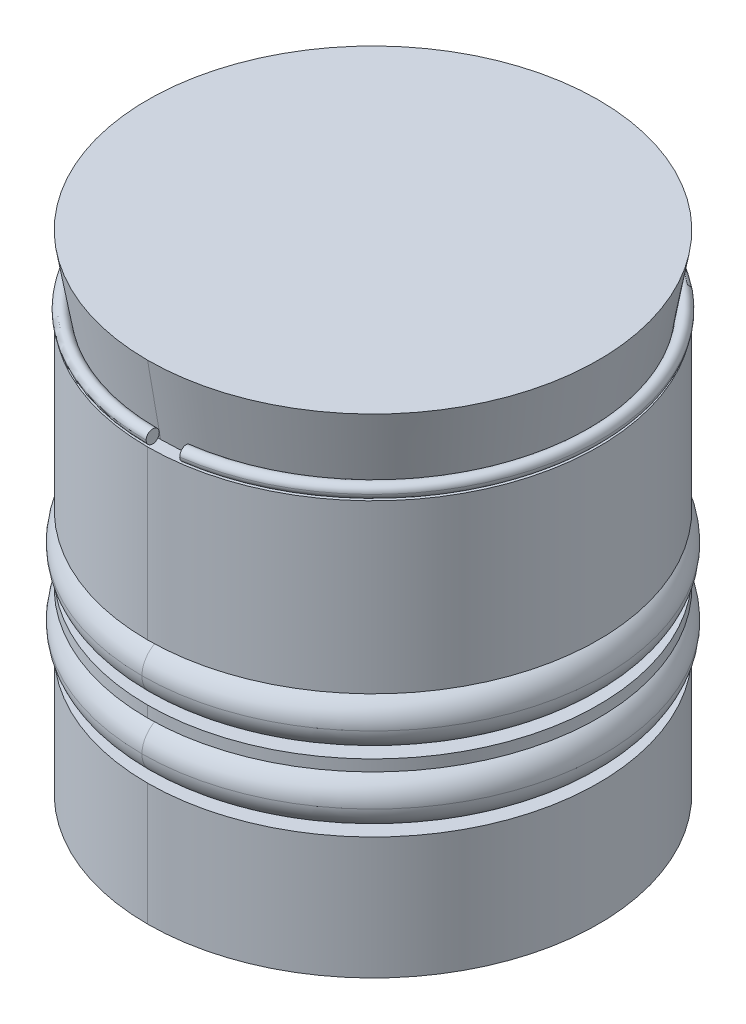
ISO-10303-21;
HEADER;
FILE_DESCRIPTION(('STEP AP214'),'2;1');
FILE_NAME('part.step','',(''),(''),'','','');
FILE_SCHEMA(('AUTOMOTIVE_DESIGN { 1 0 10303 214 1 1 1 1 }'));
ENDSEC;
DATA;
#1=APPLICATION_CONTEXT('core data for automotive mechanical design processes');
#2=APPLICATION_PROTOCOL_DEFINITION('international standard','automotive_design',2000,#1);
#3=PRODUCT_CONTEXT('',#1,'mechanical');
#4=PRODUCT('Part','Part','',(#3));
#5=PRODUCT_RELATED_PRODUCT_CATEGORY('part','',(#4));
#6=PRODUCT_DEFINITION_FORMATION('','',#4);
#7=PRODUCT_DEFINITION_CONTEXT('part definition',#1,'design');
#8=PRODUCT_DEFINITION('design','',#6,#7);
#9=PRODUCT_DEFINITION_SHAPE('','',#8);
#10=(LENGTH_UNIT() NAMED_UNIT(*) SI_UNIT(.MILLI.,.METRE.));
#11=(NAMED_UNIT(*) PLANE_ANGLE_UNIT() SI_UNIT($,.RADIAN.));
#12=(NAMED_UNIT(*) SI_UNIT($,.STERADIAN.) SOLID_ANGLE_UNIT());
#13=UNCERTAINTY_MEASURE_WITH_UNIT(LENGTH_MEASURE(1.E-05),#10,'distance_accuracy_value','');
#14=(GEOMETRIC_REPRESENTATION_CONTEXT(3) GLOBAL_UNCERTAINTY_ASSIGNED_CONTEXT((#13)) GLOBAL_UNIT_ASSIGNED_CONTEXT((#10,
#11,#12)) REPRESENTATION_CONTEXT('',''));
#15=CARTESIAN_POINT('',(0.,0.,0.));
#16=DIRECTION('',(0.,0.,1.));
#17=DIRECTION('',(1.,0.,0.));
#18=AXIS2_PLACEMENT_3D('',#15,#16,#17);
#19=CARTESIAN_POINT('',(0.,13.,0.));
#20=DIRECTION('',(0.,-1.,0.));
#21=DIRECTION('',(0.,0.,-1.));
#22=AXIS2_PLACEMENT_3D('',#19,#20,#21);
#23=PLANE('',#22);
#24=CARTESIAN_POINT('',(0.,13.,0.));
#25=DIRECTION('',(0.,1.,0.));
#26=DIRECTION('',(0.,0.,1.));
#27=AXIS2_PLACEMENT_3D('',#24,#25,#26);
#28=CIRCLE('',#27,6.);
#29=CARTESIAN_POINT('',(0.,13.,6.));
#30=VERTEX_POINT('',#29);
#31=CARTESIAN_POINT('',(0.,13.,-6.));
#32=VERTEX_POINT('',#31);
#33=EDGE_CURVE('P0_E177',#30,#32,#28,.T.);
#34=ORIENTED_EDGE('',*,*,#33,.T.);
#35=CARTESIAN_POINT('',(0.,13.,0.));
#36=DIRECTION('',(0.,1.,0.));
#37=DIRECTION('',(0.,0.,1.));
#38=AXIS2_PLACEMENT_3D('',#35,#36,#37);
#39=CIRCLE('',#38,6.);
#40=EDGE_CURVE('P0_E11',#32,#30,#39,.T.);
#41=ORIENTED_EDGE('',*,*,#40,.T.);
#42=EDGE_LOOP('',(#34,#41));
#43=FACE_BOUND('',#42,.T.);
#44=ADVANCED_FACE('P0_F16',(#43),#23,.F.);
#45=CARTESIAN_POINT('',(0.,11.,0.));
#46=DIRECTION('',(0.,1.,0.));
#47=DIRECTION('',(0.,0.,1.));
#48=AXIS2_PLACEMENT_3D('',#45,#46,#47);
#49=CONICAL_SURFACE('',#48,5.65371595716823,0.171442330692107);
#50=DIRECTION('',(0.,0.985339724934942,-0.17060371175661));
#51=VECTOR('',#50,1.);
#52=CARTESIAN_POINT('',(0.,11.,-5.65371595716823));
#53=LINE('',#52,#51);
#54=CARTESIAN_POINT('',(0.,11.,-5.65371595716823));
#55=VERTEX_POINT('',#54);
#56=EDGE_CURVE('P0_E216',#55,#32,#53,.T.);
#57=ORIENTED_EDGE('',*,*,#56,.F.);
#58=CARTESIAN_POINT('',(0.,11.,0.));
#59=DIRECTION('',(0.,1.,0.));
#60=DIRECTION('',(0.,0.,1.));
#61=AXIS2_PLACEMENT_3D('',#58,#59,#60);
#62=CIRCLE('',#61,5.65371595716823);
#63=CARTESIAN_POINT('',(0.,11.,5.65371595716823));
#64=VERTEX_POINT('',#63);
#65=EDGE_CURVE('P0_E27',#55,#64,#62,.T.);
#66=ORIENTED_EDGE('',*,*,#65,.T.);
#67=DIRECTION('',(0.,0.985339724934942,0.17060371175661));
#68=VECTOR('',#67,1.);
#69=CARTESIAN_POINT('',(0.,11.,5.65371595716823));
#70=LINE('',#69,#68);
#71=EDGE_CURVE('P0_E170',#64,#30,#70,.T.);
#72=ORIENTED_EDGE('',*,*,#71,.T.);
#73=ORIENTED_EDGE('',*,*,#40,.F.);
#74=EDGE_LOOP('',(#57,#66,#72,#73));
#75=FACE_BOUND('',#74,.T.);
#76=ADVANCED_FACE('P0_F366',(#75),#49,.T.);
#77=CARTESIAN_POINT('',(0.,11.,-6.));
#78=DIRECTION('',(0.,-1.,0.));
#79=DIRECTION('',(0.,0.,-1.));
#80=AXIS2_PLACEMENT_3D('',#77,#78,#79);
#81=PLANE('',#80);
#82=CARTESIAN_POINT('',(0.,11.,0.));
#83=DIRECTION('',(0.,1.,0.));
#84=DIRECTION('',(0.,0.,1.));
#85=AXIS2_PLACEMENT_3D('',#82,#83,#84);
#86=CIRCLE('',#85,5.65371595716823);
#87=EDGE_CURVE('P0_E212',#64,#55,#86,.T.);
#88=ORIENTED_EDGE('',*,*,#87,.F.);
#89=ORIENTED_EDGE('',*,*,#65,.F.);
#90=EDGE_LOOP('',(#88,#89));
#91=FACE_BOUND('',#90,.T.);
#92=CARTESIAN_POINT('',(0.,11.,0.));
#93=DIRECTION('',(0.,1.,0.));
#94=DIRECTION('',(0.,0.,1.));
#95=AXIS2_PLACEMENT_3D('',#92,#93,#94);
#96=CIRCLE('',#95,6.);
#97=CARTESIAN_POINT('',(0.,11.,6.));
#98=VERTEX_POINT('',#97);
#99=CARTESIAN_POINT('',(0.,11.,-6.));
#100=VERTEX_POINT('',#99);
#101=EDGE_CURVE('P0_E166',#98,#100,#96,.T.);
#102=ORIENTED_EDGE('',*,*,#101,.T.);
#103=CARTESIAN_POINT('',(0.,11.,0.));
#104=DIRECTION('',(0.,1.,0.));
#105=DIRECTION('',(0.,0.,1.));
#106=AXIS2_PLACEMENT_3D('',#103,#104,#105);
#107=CIRCLE('',#106,6.);
#108=EDGE_CURVE('P0_E156',#100,#98,#107,.T.);
#109=ORIENTED_EDGE('',*,*,#108,.T.);
#110=EDGE_LOOP('',(#102,#109));
#111=FACE_BOUND('',#110,.T.);
#112=ADVANCED_FACE('P0_F372',(#91,#111),#81,.F.);
#113=CARTESIAN_POINT('',(0.,13.,0.));
#114=DIRECTION('',(0.,1.,0.));
#115=DIRECTION('',(0.,0.,1.));
#116=AXIS2_PLACEMENT_3D('',#113,#114,#115);
#117=CYLINDRICAL_SURFACE('',#116,6.);
#118=DIRECTION('',(0.,1.,0.));
#119=VECTOR('',#118,1.);
#120=CARTESIAN_POINT('',(0.,13.,-6.));
#121=LINE('',#120,#119);
#122=CARTESIAN_POINT('',(0.,6.55,-6.));
#123=VERTEX_POINT('',#122);
#124=EDGE_CURVE('P0_E160',#123,#100,#121,.T.);
#125=ORIENTED_EDGE('',*,*,#124,.F.);
#126=CARTESIAN_POINT('',(0.,6.55,0.));
#127=DIRECTION('',(0.,1.,0.));
#128=DIRECTION('',(0.,0.,1.));
#129=AXIS2_PLACEMENT_3D('',#126,#127,#128);
#130=CIRCLE('',#129,6.);
#131=CARTESIAN_POINT('',(0.,6.55,6.));
#132=VERTEX_POINT('',#131);
#133=EDGE_CURVE('P0_E147',#123,#132,#130,.T.);
#134=ORIENTED_EDGE('',*,*,#133,.T.);
#135=DIRECTION('',(0.,1.,0.));
#136=VECTOR('',#135,1.);
#137=CARTESIAN_POINT('',(0.,13.,6.));
#138=LINE('',#137,#136);
#139=EDGE_CURVE('P0_E168',#132,#98,#138,.T.);
#140=ORIENTED_EDGE('',*,*,#139,.T.);
#141=ORIENTED_EDGE('',*,*,#108,.F.);
#142=EDGE_LOOP('',(#125,#134,#140,#141));
#143=FACE_BOUND('',#142,.T.);
#144=ADVANCED_FACE('P0_F161',(#143),#117,.T.);
#145=CARTESIAN_POINT('',(0.,6.55,-5.5));
#146=DIRECTION('',(0.,1.,0.));
#147=DIRECTION('',(0.,0.,-1.));
#148=AXIS2_PLACEMENT_3D('',#145,#146,#147);
#149=PLANE('',#148);
#150=CARTESIAN_POINT('',(0.,6.55,0.));
#151=DIRECTION('',(0.,1.,0.));
#152=DIRECTION('',(0.,0.,1.));
#153=AXIS2_PLACEMENT_3D('',#150,#151,#152);
#154=CIRCLE('',#153,5.5);
#155=CARTESIAN_POINT('',(0.,6.55,5.5));
#156=VERTEX_POINT('',#155);
#157=CARTESIAN_POINT('',(0.,6.55,-5.5));
#158=VERTEX_POINT('',#157);
#159=EDGE_CURVE('P0_E222',#156,#158,#154,.T.);
#160=ORIENTED_EDGE('',*,*,#159,.T.);
#161=CARTESIAN_POINT('',(0.,6.55,0.));
#162=DIRECTION('',(0.,1.,0.));
#163=DIRECTION('',(0.,0.,1.));
#164=AXIS2_PLACEMENT_3D('',#161,#162,#163);
#165=CIRCLE('',#164,5.5);
#166=EDGE_CURVE('P0_E217',#158,#156,#165,.T.);
#167=ORIENTED_EDGE('',*,*,#166,.T.);
#168=EDGE_LOOP('',(#160,#167));
#169=FACE_BOUND('',#168,.T.);
#170=CARTESIAN_POINT('',(0.,6.55,0.));
#171=DIRECTION('',(0.,1.,0.));
#172=DIRECTION('',(0.,0.,1.));
#173=AXIS2_PLACEMENT_3D('',#170,#171,#172);
#174=CIRCLE('',#173,6.);
#175=EDGE_CURVE('P0_E151',#132,#123,#174,.T.);
#176=ORIENTED_EDGE('',*,*,#175,.F.);
#177=ORIENTED_EDGE('',*,*,#133,.F.);
#178=EDGE_LOOP('',(#176,#177));
#179=FACE_BOUND('',#178,.T.);
#180=ADVANCED_FACE('P0_F149',(#169,#179),#149,.F.);
#181=CARTESIAN_POINT('',(0.,5.8,0.));
#182=DIRECTION('',(0.,1.,0.));
#183=DIRECTION('',(0.,0.,1.));
#184=AXIS2_PLACEMENT_3D('',#181,#182,#183);
#185=TOROIDAL_SURFACE('',#184,5.5,0.75);
#186=CARTESIAN_POINT('',(0.,5.8,0.));
#187=DIRECTION('',(0.,1.,0.));
#188=DIRECTION('',(0.,0.,1.));
#189=AXIS2_PLACEMENT_3D('',#186,#187,#188);
#190=CIRCLE('',#189,4.75);
#191=CARTESIAN_POINT('',(0.,5.8,4.75));
#192=VERTEX_POINT('',#191);
#193=CARTESIAN_POINT('',(0.,5.8,-4.75));
#194=VERTEX_POINT('',#193);
#195=EDGE_CURVE('P0_E223',#192,#194,#190,.T.);
#196=ORIENTED_EDGE('',*,*,#195,.F.);
#197=CARTESIAN_POINT('',(0.,5.8,5.5));
#198=DIRECTION('',(-1.,0.,0.));
#199=DIRECTION('',(0.,0.,1.));
#200=AXIS2_PLACEMENT_3D('',#197,#198,#199);
#201=CIRCLE('',#200,0.75);
#202=CARTESIAN_POINT('',(0.,5.05,5.5));
#203=VERTEX_POINT('',#202);
#204=EDGE_CURVE('P0_E271',#192,#203,#201,.T.);
#205=ORIENTED_EDGE('',*,*,#204,.T.);
#206=CARTESIAN_POINT('',(0.,5.05,0.));
#207=DIRECTION('',(0.,1.,0.));
#208=DIRECTION('',(0.,0.,1.));
#209=AXIS2_PLACEMENT_3D('',#206,#207,#208);
#210=CIRCLE('',#209,5.5);
#211=CARTESIAN_POINT('',(0.,5.05,-5.5));
#212=VERTEX_POINT('',#211);
#213=EDGE_CURVE('P0_E157',#203,#212,#210,.T.);
#214=ORIENTED_EDGE('',*,*,#213,.T.);
#215=CARTESIAN_POINT('',(0.,5.8,-5.5));
#216=DIRECTION('',(1.,0.,0.));
#217=DIRECTION('',(0.,0.,-1.));
#218=AXIS2_PLACEMENT_3D('',#215,#216,#217);
#219=CIRCLE('',#218,0.75);
#220=EDGE_CURVE('P0_E233',#194,#212,#219,.T.);
#221=ORIENTED_EDGE('',*,*,#220,.F.);
#222=EDGE_LOOP('',(#196,#205,#214,#221));
#223=FACE_BOUND('',#222,.T.);
#224=ADVANCED_FACE('P0_F353',(#223),#185,.F.);
#225=CARTESIAN_POINT('',(0.,5.05,-5.5));
#226=DIRECTION('',(0.,-1.,0.));
#227=DIRECTION('',(0.,0.,-1.));
#228=AXIS2_PLACEMENT_3D('',#225,#226,#227);
#229=PLANE('',#228);
#230=ORIENTED_EDGE('',*,*,#213,.F.);
#231=CARTESIAN_POINT('',(0.,5.05,0.));
#232=DIRECTION('',(0.,1.,0.));
#233=DIRECTION('',(0.,0.,1.));
#234=AXIS2_PLACEMENT_3D('',#231,#232,#233);
#235=CIRCLE('',#234,5.5);
#236=EDGE_CURVE('P0_E274',#212,#203,#235,.T.);
#237=ORIENTED_EDGE('',*,*,#236,.F.);
#238=EDGE_LOOP('',(#230,#237));
#239=FACE_BOUND('',#238,.T.);
#240=CARTESIAN_POINT('',(0.,5.05,0.));
#241=DIRECTION('',(0.,1.,0.));
#242=DIRECTION('',(0.,0.,1.));
#243=AXIS2_PLACEMENT_3D('',#240,#241,#242);
#244=CIRCLE('',#243,6.);
#245=CARTESIAN_POINT('',(0.,5.05,6.));
#246=VERTEX_POINT('',#245);
#247=CARTESIAN_POINT('',(0.,5.05,-6.));
#248=VERTEX_POINT('',#247);
#249=EDGE_CURVE('P0_E201',#246,#248,#244,.T.);
#250=ORIENTED_EDGE('',*,*,#249,.T.);
#251=CARTESIAN_POINT('',(0.,5.05,0.));
#252=DIRECTION('',(0.,1.,0.));
#253=DIRECTION('',(0.,0.,1.));
#254=AXIS2_PLACEMENT_3D('',#251,#252,#253);
#255=CIRCLE('',#254,6.);
#256=EDGE_CURVE('P0_E266',#248,#246,#255,.T.);
#257=ORIENTED_EDGE('',*,*,#256,.T.);
#258=EDGE_LOOP('',(#250,#257));
#259=FACE_BOUND('',#258,.T.);
#260=ADVANCED_FACE('P0_F351',(#239,#259),#229,.F.);
#261=CARTESIAN_POINT('',(0.,13.,0.));
#262=DIRECTION('',(0.,1.,0.));
#263=DIRECTION('',(0.,0.,1.));
#264=AXIS2_PLACEMENT_3D('',#261,#262,#263);
#265=CYLINDRICAL_SURFACE('',#264,6.);
#266=DIRECTION('',(0.,1.,0.));
#267=VECTOR('',#266,1.);
#268=CARTESIAN_POINT('',(0.,13.,-6.));
#269=LINE('',#268,#267);
#270=CARTESIAN_POINT('',(0.,4.75,-6.));
#271=VERTEX_POINT('',#270);
#272=EDGE_CURVE('P0_E197',#271,#248,#269,.T.);
#273=ORIENTED_EDGE('',*,*,#272,.F.);
#274=CARTESIAN_POINT('',(0.,4.75,0.));
#275=DIRECTION('',(0.,1.,0.));
#276=DIRECTION('',(0.,0.,1.));
#277=AXIS2_PLACEMENT_3D('',#274,#275,#276);
#278=CIRCLE('',#277,6.);
#279=CARTESIAN_POINT('',(0.,4.75,6.));
#280=VERTEX_POINT('',#279);
#281=EDGE_CURVE('P0_E211',#271,#280,#278,.T.);
#282=ORIENTED_EDGE('',*,*,#281,.T.);
#283=DIRECTION('',(0.,1.,0.));
#284=VECTOR('',#283,1.);
#285=CARTESIAN_POINT('',(0.,13.,6.));
#286=LINE('',#285,#284);
#287=EDGE_CURVE('P0_E224',#280,#246,#286,.T.);
#288=ORIENTED_EDGE('',*,*,#287,.T.);
#289=ORIENTED_EDGE('',*,*,#256,.F.);
#290=EDGE_LOOP('',(#273,#282,#288,#289));
#291=FACE_BOUND('',#290,.T.);
#292=ADVANCED_FACE('P0_F338',(#291),#265,.T.);
#293=CARTESIAN_POINT('',(0.,4.75,-5.5));
#294=DIRECTION('',(0.,1.,0.));
#295=DIRECTION('',(0.,0.,-1.));
#296=AXIS2_PLACEMENT_3D('',#293,#294,#295);
#297=PLANE('',#296);
#298=CARTESIAN_POINT('',(0.,4.75,0.));
#299=DIRECTION('',(0.,1.,0.));
#300=DIRECTION('',(0.,0.,1.));
#301=AXIS2_PLACEMENT_3D('',#298,#299,#300);
#302=CIRCLE('',#301,5.5);
#303=CARTESIAN_POINT('',(0.,4.75,5.5));
#304=VERTEX_POINT('',#303);
#305=CARTESIAN_POINT('',(0.,4.75,-5.5));
#306=VERTEX_POINT('',#305);
#307=EDGE_CURVE('P0_E193',#304,#306,#302,.T.);
#308=ORIENTED_EDGE('',*,*,#307,.T.);
#309=CARTESIAN_POINT('',(0.,4.75,0.));
#310=DIRECTION('',(0.,1.,0.));
#311=DIRECTION('',(0.,0.,1.));
#312=AXIS2_PLACEMENT_3D('',#309,#310,#311);
#313=CIRCLE('',#312,5.5);
#314=EDGE_CURVE('P0_E244',#306,#304,#313,.T.);
#315=ORIENTED_EDGE('',*,*,#314,.T.);
#316=EDGE_LOOP('',(#308,#315));
#317=FACE_BOUND('',#316,.T.);
#318=CARTESIAN_POINT('',(0.,4.75,0.));
#319=DIRECTION('',(0.,1.,0.));
#320=DIRECTION('',(0.,0.,1.));
#321=AXIS2_PLACEMENT_3D('',#318,#319,#320);
#322=CIRCLE('',#321,6.);
#323=EDGE_CURVE('P0_E202',#280,#271,#322,.T.);
#324=ORIENTED_EDGE('',*,*,#323,.F.);
#325=ORIENTED_EDGE('',*,*,#281,.F.);
#326=EDGE_LOOP('',(#324,#325));
#327=FACE_BOUND('',#326,.T.);
#328=ADVANCED_FACE('P0_F335',(#317,#327),#297,.F.);
#329=CARTESIAN_POINT('',(0.,4.,0.));
#330=DIRECTION('',(0.,1.,0.));
#331=DIRECTION('',(0.,0.,1.));
#332=AXIS2_PLACEMENT_3D('',#329,#330,#331);
#333=TOROIDAL_SURFACE('',#332,5.5,0.75);
#334=CARTESIAN_POINT('',(0.,4.,0.));
#335=DIRECTION('',(0.,1.,0.));
#336=DIRECTION('',(0.,0.,1.));
#337=AXIS2_PLACEMENT_3D('',#334,#335,#336);
#338=CIRCLE('',#337,4.75);
#339=CARTESIAN_POINT('',(0.,4.,4.75));
#340=VERTEX_POINT('',#339);
#341=CARTESIAN_POINT('',(0.,4.,-4.75));
#342=VERTEX_POINT('',#341);
#343=EDGE_CURVE('P0_E194',#340,#342,#338,.T.);
#344=ORIENTED_EDGE('',*,*,#343,.F.);
#345=CARTESIAN_POINT('',(0.,4.,5.5));
#346=DIRECTION('',(-1.,0.,0.));
#347=DIRECTION('',(0.,0.,1.));
#348=AXIS2_PLACEMENT_3D('',#345,#346,#347);
#349=CIRCLE('',#348,0.75);
#350=CARTESIAN_POINT('',(0.,3.25,5.5));
#351=VERTEX_POINT('',#350);
#352=EDGE_CURVE('P0_E183',#340,#351,#349,.T.);
#353=ORIENTED_EDGE('',*,*,#352,.T.);
#354=CARTESIAN_POINT('',(0.,3.25,0.));
#355=DIRECTION('',(0.,1.,0.));
#356=DIRECTION('',(0.,0.,1.));
#357=AXIS2_PLACEMENT_3D('',#354,#355,#356);
#358=CIRCLE('',#357,5.5);
#359=CARTESIAN_POINT('',(0.,3.25,-5.5));
#360=VERTEX_POINT('',#359);
#361=EDGE_CURVE('P0_E208',#351,#360,#358,.T.);
#362=ORIENTED_EDGE('',*,*,#361,.T.);
#363=CARTESIAN_POINT('',(0.,4.,-5.5));
#364=DIRECTION('',(1.,0.,0.));
#365=DIRECTION('',(0.,0.,-1.));
#366=AXIS2_PLACEMENT_3D('',#363,#364,#365);
#367=CIRCLE('',#366,0.75);
#368=EDGE_CURVE('P0_E227',#342,#360,#367,.T.);
#369=ORIENTED_EDGE('',*,*,#368,.F.);
#370=EDGE_LOOP('',(#344,#353,#362,#369));
#371=FACE_BOUND('',#370,.T.);
#372=ADVANCED_FACE('P0_F327',(#371),#333,.F.);
#373=CARTESIAN_POINT('',(0.,3.25,-5.5));
#374=DIRECTION('',(0.,-1.,0.));
#375=DIRECTION('',(0.,0.,-1.));
#376=AXIS2_PLACEMENT_3D('',#373,#374,#375);
#377=PLANE('',#376);
#378=ORIENTED_EDGE('',*,*,#361,.F.);
#379=CARTESIAN_POINT('',(0.,3.25,0.));
#380=DIRECTION('',(0.,1.,0.));
#381=DIRECTION('',(0.,0.,1.));
#382=AXIS2_PLACEMENT_3D('',#379,#380,#381);
#383=CIRCLE('',#382,5.5);
#384=EDGE_CURVE('P0_E188',#360,#351,#383,.T.);
#385=ORIENTED_EDGE('',*,*,#384,.F.);
#386=EDGE_LOOP('',(#378,#385));
#387=FACE_BOUND('',#386,.T.);
#388=CARTESIAN_POINT('',(0.,3.25,0.));
#389=DIRECTION('',(0.,1.,0.));
#390=DIRECTION('',(0.,0.,1.));
#391=AXIS2_PLACEMENT_3D('',#388,#389,#390);
#392=CIRCLE('',#391,6.);
#393=CARTESIAN_POINT('',(0.,3.25,6.));
#394=VERTEX_POINT('',#393);
#395=CARTESIAN_POINT('',(0.,3.25,-6.));
#396=VERTEX_POINT('',#395);
#397=EDGE_CURVE('P0_E207',#394,#396,#392,.T.);
#398=ORIENTED_EDGE('',*,*,#397,.T.);
#399=CARTESIAN_POINT('',(0.,3.25,0.));
#400=DIRECTION('',(0.,1.,0.));
#401=DIRECTION('',(0.,0.,1.));
#402=AXIS2_PLACEMENT_3D('',#399,#400,#401);
#403=CIRCLE('',#402,6.);
#404=EDGE_CURVE('P0_E40',#396,#394,#403,.T.);
#405=ORIENTED_EDGE('',*,*,#404,.T.);
#406=EDGE_LOOP('',(#398,#405));
#407=FACE_BOUND('',#406,.T.);
#408=ADVANCED_FACE('P0_F404',(#387,#407),#377,.F.);
#409=CARTESIAN_POINT('',(0.,13.,0.));
#410=DIRECTION('',(0.,1.,0.));
#411=DIRECTION('',(0.,0.,1.));
#412=AXIS2_PLACEMENT_3D('',#409,#410,#411);
#413=CYLINDRICAL_SURFACE('',#412,6.);
#414=DIRECTION('',(0.,1.,0.));
#415=VECTOR('',#414,1.);
#416=CARTESIAN_POINT('',(0.,13.,-6.));
#417=LINE('',#416,#415);
#418=CARTESIAN_POINT('',(0.,0.,-6.));
#419=VERTEX_POINT('',#418);
#420=EDGE_CURVE('P0_E203',#419,#396,#417,.T.);
#421=ORIENTED_EDGE('',*,*,#420,.F.);
#422=CARTESIAN_POINT('',(0.,0.,0.));
#423=DIRECTION('',(0.,1.,0.));
#424=DIRECTION('',(0.,0.,1.));
#425=AXIS2_PLACEMENT_3D('',#422,#423,#424);
#426=CIRCLE('',#425,6.);
#427=CARTESIAN_POINT('',(0.,0.,6.));
#428=VERTEX_POINT('',#427);
#429=EDGE_CURVE('P0_E20',#419,#428,#426,.T.);
#430=ORIENTED_EDGE('',*,*,#429,.T.);
#431=DIRECTION('',(0.,1.,0.));
#432=VECTOR('',#431,1.);
#433=CARTESIAN_POINT('',(0.,13.,6.));
#434=LINE('',#433,#432);
#435=EDGE_CURVE('P0_E180',#428,#394,#434,.T.);
#436=ORIENTED_EDGE('',*,*,#435,.T.);
#437=ORIENTED_EDGE('',*,*,#404,.F.);
#438=EDGE_LOOP('',(#421,#430,#436,#437));
#439=FACE_BOUND('',#438,.T.);
#440=ADVANCED_FACE('P0_F393',(#439),#413,.T.);
#441=CARTESIAN_POINT('',(0.,0.,-6.));
#442=DIRECTION('',(0.,1.,0.));
#443=DIRECTION('',(0.,0.,-1.));
#444=AXIS2_PLACEMENT_3D('',#441,#442,#443);
#445=PLANE('',#444);
#446=CARTESIAN_POINT('',(0.,0.,0.));
#447=DIRECTION('',(0.,1.,0.));
#448=DIRECTION('',(0.,0.,1.));
#449=AXIS2_PLACEMENT_3D('',#446,#447,#448);
#450=CIRCLE('',#449,6.);
#451=EDGE_CURVE('P0_E187',#428,#419,#450,.T.);
#452=ORIENTED_EDGE('',*,*,#451,.F.);
#453=ORIENTED_EDGE('',*,*,#429,.F.);
#454=EDGE_LOOP('',(#452,#453));
#455=FACE_BOUND('',#454,.T.);
#456=ADVANCED_FACE('P0_F389',(#455),#445,.F.);
#457=CARTESIAN_POINT('',(0.,13.,0.));
#458=DIRECTION('',(0.,1.,0.));
#459=DIRECTION('',(0.,0.,1.));
#460=AXIS2_PLACEMENT_3D('',#457,#458,#459);
#461=CYLINDRICAL_SURFACE('',#460,6.);
#462=ORIENTED_EDGE('',*,*,#451,.T.);
#463=ORIENTED_EDGE('',*,*,#420,.T.);
#464=ORIENTED_EDGE('',*,*,#397,.F.);
#465=ORIENTED_EDGE('',*,*,#435,.F.);
#466=EDGE_LOOP('',(#462,#463,#464,#465));
#467=FACE_BOUND('',#466,.T.);
#468=ADVANCED_FACE('P0_F392',(#467),#461,.T.);
#469=CARTESIAN_POINT('',(0.,4.,0.));
#470=DIRECTION('',(0.,1.,0.));
#471=DIRECTION('',(0.,0.,1.));
#472=AXIS2_PLACEMENT_3D('',#469,#470,#471);
#473=TOROIDAL_SURFACE('',#472,5.5,0.75);
#474=CARTESIAN_POINT('',(0.,4.,0.));
#475=DIRECTION('',(0.,1.,0.));
#476=DIRECTION('',(0.,0.,1.));
#477=AXIS2_PLACEMENT_3D('',#474,#475,#476);
#478=CIRCLE('',#477,4.75);
#479=EDGE_CURVE('P0_E248',#342,#340,#478,.T.);
#480=ORIENTED_EDGE('',*,*,#479,.F.);
#481=ORIENTED_EDGE('',*,*,#368,.T.);
#482=ORIENTED_EDGE('',*,*,#384,.T.);
#483=ORIENTED_EDGE('',*,*,#352,.F.);
#484=EDGE_LOOP('',(#480,#481,#482,#483));
#485=FACE_BOUND('',#484,.T.);
#486=ADVANCED_FACE('P0_F331',(#485),#473,.F.);
#487=CARTESIAN_POINT('',(0.,13.,0.));
#488=DIRECTION('',(0.,1.,0.));
#489=DIRECTION('',(0.,0.,1.));
#490=AXIS2_PLACEMENT_3D('',#487,#488,#489);
#491=CYLINDRICAL_SURFACE('',#490,6.);
#492=ORIENTED_EDGE('',*,*,#323,.T.);
#493=ORIENTED_EDGE('',*,*,#272,.T.);
#494=ORIENTED_EDGE('',*,*,#249,.F.);
#495=ORIENTED_EDGE('',*,*,#287,.F.);
#496=EDGE_LOOP('',(#492,#493,#494,#495));
#497=FACE_BOUND('',#496,.T.);
#498=ADVANCED_FACE('P0_F344',(#497),#491,.T.);
#499=CARTESIAN_POINT('',(0.,5.8,0.));
#500=DIRECTION('',(0.,1.,0.));
#501=DIRECTION('',(0.,0.,1.));
#502=AXIS2_PLACEMENT_3D('',#499,#500,#501);
#503=TOROIDAL_SURFACE('',#502,5.5,0.75);
#504=CARTESIAN_POINT('',(0.,5.8,0.));
#505=DIRECTION('',(0.,1.,0.));
#506=DIRECTION('',(0.,0.,1.));
#507=AXIS2_PLACEMENT_3D('',#504,#505,#506);
#508=CIRCLE('',#507,4.75);
#509=EDGE_CURVE('P0_E247',#194,#192,#508,.T.);
#510=ORIENTED_EDGE('',*,*,#509,.F.);
#511=ORIENTED_EDGE('',*,*,#220,.T.);
#512=ORIENTED_EDGE('',*,*,#236,.T.);
#513=ORIENTED_EDGE('',*,*,#204,.F.);
#514=EDGE_LOOP('',(#510,#511,#512,#513));
#515=FACE_BOUND('',#514,.T.);
#516=ADVANCED_FACE('P0_F381',(#515),#503,.F.);
#517=CARTESIAN_POINT('',(0.,13.,0.));
#518=DIRECTION('',(0.,1.,0.));
#519=DIRECTION('',(0.,0.,1.));
#520=AXIS2_PLACEMENT_3D('',#517,#518,#519);
#521=CYLINDRICAL_SURFACE('',#520,6.);
#522=ORIENTED_EDGE('',*,*,#175,.T.);
#523=ORIENTED_EDGE('',*,*,#124,.T.);
#524=ORIENTED_EDGE('',*,*,#101,.F.);
#525=ORIENTED_EDGE('',*,*,#139,.F.);
#526=EDGE_LOOP('',(#522,#523,#524,#525));
#527=FACE_BOUND('',#526,.T.);
#528=ADVANCED_FACE('P0_F18',(#527),#521,.T.);
#529=CARTESIAN_POINT('',(0.,11.,0.));
#530=DIRECTION('',(0.,1.,0.));
#531=DIRECTION('',(0.,0.,1.));
#532=AXIS2_PLACEMENT_3D('',#529,#530,#531);
#533=CONICAL_SURFACE('',#532,5.65371595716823,0.171442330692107);
#534=ORIENTED_EDGE('',*,*,#87,.T.);
#535=ORIENTED_EDGE('',*,*,#56,.T.);
#536=ORIENTED_EDGE('',*,*,#33,.F.);
#537=ORIENTED_EDGE('',*,*,#71,.F.);
#538=EDGE_LOOP('',(#534,#535,#536,#537));
#539=FACE_BOUND('',#538,.T.);
#540=ADVANCED_FACE('P0_F386',(#539),#533,.T.);
#541=CARTESIAN_POINT('',(0.,5.8,0.));
#542=DIRECTION('',(0.,1.,0.));
#543=DIRECTION('',(0.,0.,1.));
#544=AXIS2_PLACEMENT_3D('',#541,#542,#543);
#545=TOROIDAL_SURFACE('',#544,5.5,0.75);
#546=CARTESIAN_POINT('',(0.,5.8,-5.5));
#547=DIRECTION('',(1.,0.,0.));
#548=DIRECTION('',(0.,0.,-1.));
#549=AXIS2_PLACEMENT_3D('',#546,#547,#548);
#550=CIRCLE('',#549,0.75);
#551=EDGE_CURVE('P0_E218',#158,#194,#550,.T.);
#552=ORIENTED_EDGE('',*,*,#551,.T.);
#553=ORIENTED_EDGE('',*,*,#509,.T.);
#554=CARTESIAN_POINT('',(0.,5.8,5.5));
#555=DIRECTION('',(-1.,0.,0.));
#556=DIRECTION('',(0.,0.,1.));
#557=AXIS2_PLACEMENT_3D('',#554,#555,#556);
#558=CIRCLE('',#557,0.75);
#559=EDGE_CURVE('P0_E257',#156,#192,#558,.T.);
#560=ORIENTED_EDGE('',*,*,#559,.F.);
#561=ORIENTED_EDGE('',*,*,#166,.F.);
#562=EDGE_LOOP('',(#552,#553,#560,#561));
#563=FACE_BOUND('',#562,.T.);
#564=ADVANCED_FACE('P0_F384',(#563),#545,.F.);
#565=CARTESIAN_POINT('',(0.,4.,0.));
#566=DIRECTION('',(0.,1.,0.));
#567=DIRECTION('',(0.,0.,1.));
#568=AXIS2_PLACEMENT_3D('',#565,#566,#567);
#569=TOROIDAL_SURFACE('',#568,5.5,0.75);
#570=CARTESIAN_POINT('',(0.,4.,-5.5));
#571=DIRECTION('',(1.,0.,0.));
#572=DIRECTION('',(0.,0.,-1.));
#573=AXIS2_PLACEMENT_3D('',#570,#571,#572);
#574=CIRCLE('',#573,0.75);
#575=EDGE_CURVE('P0_E189',#306,#342,#574,.T.);
#576=ORIENTED_EDGE('',*,*,#575,.T.);
#577=ORIENTED_EDGE('',*,*,#479,.T.);
#578=CARTESIAN_POINT('',(0.,4.,5.5));
#579=DIRECTION('',(-1.,0.,0.));
#580=DIRECTION('',(0.,0.,1.));
#581=AXIS2_PLACEMENT_3D('',#578,#579,#580);
#582=CIRCLE('',#581,0.75);
#583=EDGE_CURVE('P0_E237',#304,#340,#582,.T.);
#584=ORIENTED_EDGE('',*,*,#583,.F.);
#585=ORIENTED_EDGE('',*,*,#314,.F.);
#586=EDGE_LOOP('',(#576,#577,#584,#585));
#587=FACE_BOUND('',#586,.T.);
#588=ADVANCED_FACE('P0_F333',(#587),#569,.F.);
#589=CARTESIAN_POINT('',(0.,4.,0.));
#590=DIRECTION('',(0.,1.,0.));
#591=DIRECTION('',(0.,0.,1.));
#592=AXIS2_PLACEMENT_3D('',#589,#590,#591);
#593=TOROIDAL_SURFACE('',#592,5.5,0.75);
#594=ORIENTED_EDGE('',*,*,#583,.T.);
#595=ORIENTED_EDGE('',*,*,#343,.T.);
#596=ORIENTED_EDGE('',*,*,#575,.F.);
#597=ORIENTED_EDGE('',*,*,#307,.F.);
#598=EDGE_LOOP('',(#594,#595,#596,#597));
#599=FACE_BOUND('',#598,.T.);
#600=ADVANCED_FACE('P0_F323',(#599),#593,.F.);
#601=CARTESIAN_POINT('',(0.,5.8,0.));
#602=DIRECTION('',(0.,1.,0.));
#603=DIRECTION('',(0.,0.,1.));
#604=AXIS2_PLACEMENT_3D('',#601,#602,#603);
#605=TOROIDAL_SURFACE('',#604,5.5,0.75);
#606=ORIENTED_EDGE('',*,*,#559,.T.);
#607=ORIENTED_EDGE('',*,*,#195,.T.);
#608=ORIENTED_EDGE('',*,*,#551,.F.);
#609=ORIENTED_EDGE('',*,*,#159,.F.);
#610=EDGE_LOOP('',(#606,#607,#608,#609));
#611=FACE_BOUND('',#610,.T.);
#612=ADVANCED_FACE('P0_F400',(#611),#605,.F.);
#613=CLOSED_SHELL('',(#44,#76,#112,#144,#180,#224,#260,#292,#328,#372,#408,#440,#456,#468,#486,
#498,#516,#528,#540,#564,#588,#600,#612));
#614=MANIFOLD_SOLID_BREP('P0_B1',#613);
#615=CARTESIAN_POINT('',(0.,5.8,0.));
#616=DIRECTION('',(0.,1.,0.));
#617=DIRECTION('',(0.,0.,1.));
#618=AXIS2_PLACEMENT_3D('',#615,#616,#617);
#619=TOROIDAL_SURFACE('',#618,5.5,0.65);
#620=CARTESIAN_POINT('',(0.,5.8,0.));
#621=DIRECTION('',(0.,1.,0.));
#622=DIRECTION('',(0.,0.,1.));
#623=AXIS2_PLACEMENT_3D('',#620,#621,#622);
#624=CIRCLE('',#623,6.15);
#625=CARTESIAN_POINT('',(0.,5.8,-6.15));
#626=VERTEX_POINT('',#625);
#627=CARTESIAN_POINT('',(0.,5.8,6.15));
#628=VERTEX_POINT('',#627);
#629=EDGE_CURVE('P1_E70',#626,#628,#624,.T.);
#630=ORIENTED_EDGE('',*,*,#629,.F.);
#631=CARTESIAN_POINT('',(0.,5.8,-5.5));
#632=DIRECTION('',(1.,0.,0.));
#633=DIRECTION('',(0.,0.,-1.));
#634=AXIS2_PLACEMENT_3D('',#631,#632,#633);
#635=CIRCLE('',#634,0.65);
#636=CARTESIAN_POINT('',(0.,5.8,-4.85));
#637=VERTEX_POINT('',#636);
#638=EDGE_CURVE('P1_E11',#637,#626,#635,.T.);
#639=ORIENTED_EDGE('',*,*,#638,.F.);
#640=CARTESIAN_POINT('',(0.,5.8,0.));
#641=DIRECTION('',(0.,1.,0.));
#642=DIRECTION('',(0.,0.,1.));
#643=AXIS2_PLACEMENT_3D('',#640,#641,#642);
#644=CIRCLE('',#643,4.85);
#645=CARTESIAN_POINT('',(0.,5.8,4.85));
#646=VERTEX_POINT('',#645);
#647=EDGE_CURVE('P1_E20',#637,#646,#644,.T.);
#648=ORIENTED_EDGE('',*,*,#647,.T.);
#649=CARTESIAN_POINT('',(0.,5.8,5.5));
#650=DIRECTION('',(-1.,0.,0.));
#651=DIRECTION('',(0.,0.,1.));
#652=AXIS2_PLACEMENT_3D('',#649,#650,#651);
#653=CIRCLE('',#652,0.65);
#654=EDGE_CURVE('P1_E27',#646,#628,#653,.T.);
#655=ORIENTED_EDGE('',*,*,#654,.T.);
#656=EDGE_LOOP('',(#630,#639,#648,#655));
#657=FACE_BOUND('',#656,.T.);
#658=ADVANCED_FACE('P1_F16',(#657),#619,.T.);
#659=CARTESIAN_POINT('',(0.,5.8,0.));
#660=DIRECTION('',(0.,1.,0.));
#661=DIRECTION('',(0.,0.,1.));
#662=AXIS2_PLACEMENT_3D('',#659,#660,#661);
#663=TOROIDAL_SURFACE('',#662,5.5,0.65);
#664=CARTESIAN_POINT('',(0.,5.8,0.));
#665=DIRECTION('',(0.,1.,0.));
#666=DIRECTION('',(0.,0.,1.));
#667=AXIS2_PLACEMENT_3D('',#664,#665,#666);
#668=CIRCLE('',#667,6.15);
#669=EDGE_CURVE('P1_E57',#628,#626,#668,.T.);
#670=ORIENTED_EDGE('',*,*,#669,.F.);
#671=ORIENTED_EDGE('',*,*,#654,.F.);
#672=CARTESIAN_POINT('',(0.,5.8,0.));
#673=DIRECTION('',(0.,1.,0.));
#674=DIRECTION('',(0.,0.,1.));
#675=AXIS2_PLACEMENT_3D('',#672,#673,#674);
#676=CIRCLE('',#675,4.85);
#677=EDGE_CURVE('P1_E59',#646,#637,#676,.T.);
#678=ORIENTED_EDGE('',*,*,#677,.T.);
#679=ORIENTED_EDGE('',*,*,#638,.T.);
#680=EDGE_LOOP('',(#670,#671,#678,#679));
#681=FACE_BOUND('',#680,.T.);
#682=ADVANCED_FACE('P1_F56',(#681),#663,.T.);
#683=CARTESIAN_POINT('',(0.,5.8,0.));
#684=DIRECTION('',(0.,1.,0.));
#685=DIRECTION('',(0.,0.,1.));
#686=AXIS2_PLACEMENT_3D('',#683,#684,#685);
#687=TOROIDAL_SURFACE('',#686,5.5,0.65);
#688=CARTESIAN_POINT('',(0.,5.8,5.5));
#689=DIRECTION('',(-1.,0.,0.));
#690=DIRECTION('',(0.,0.,1.));
#691=AXIS2_PLACEMENT_3D('',#688,#689,#690);
#692=CIRCLE('',#691,0.65);
#693=EDGE_CURVE('P1_E66',#628,#646,#692,.T.);
#694=ORIENTED_EDGE('',*,*,#693,.F.);
#695=ORIENTED_EDGE('',*,*,#669,.T.);
#696=CARTESIAN_POINT('',(0.,5.8,-5.5));
#697=DIRECTION('',(1.,0.,0.));
#698=DIRECTION('',(0.,0.,-1.));
#699=AXIS2_PLACEMENT_3D('',#696,#697,#698);
#700=CIRCLE('',#699,0.65);
#701=EDGE_CURVE('P1_E64',#626,#637,#700,.T.);
#702=ORIENTED_EDGE('',*,*,#701,.T.);
#703=ORIENTED_EDGE('',*,*,#677,.F.);
#704=EDGE_LOOP('',(#694,#695,#702,#703));
#705=FACE_BOUND('',#704,.T.);
#706=ADVANCED_FACE('P1_F18',(#705),#687,.T.);
#707=CARTESIAN_POINT('',(0.,5.8,0.));
#708=DIRECTION('',(0.,1.,0.));
#709=DIRECTION('',(0.,0.,1.));
#710=AXIS2_PLACEMENT_3D('',#707,#708,#709);
#711=TOROIDAL_SURFACE('',#710,5.5,0.65);
#712=ORIENTED_EDGE('',*,*,#701,.F.);
#713=ORIENTED_EDGE('',*,*,#629,.T.);
#714=ORIENTED_EDGE('',*,*,#693,.T.);
#715=ORIENTED_EDGE('',*,*,#647,.F.);
#716=EDGE_LOOP('',(#712,#713,#714,#715));
#717=FACE_BOUND('',#716,.T.);
#718=ADVANCED_FACE('P1_F74',(#717),#711,.T.);
#719=CLOSED_SHELL('',(#658,#682,#706,#718));
#720=MANIFOLD_SOLID_BREP('P1_B1',#719);
#721=CARTESIAN_POINT('',(0.812546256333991,11.175,5.80761578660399));
#722=DIRECTION('',(0.990353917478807,0.,-0.138560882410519));
#723=DIRECTION('',(0.,-1.,0.));
#724=AXIS2_PLACEMENT_3D('',#721,#722,#723);
#725=PLANE('',#724);
#726=CARTESIAN_POINT('',(0.812546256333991,11.175,5.80761578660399));
#727=DIRECTION('',(0.990353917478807,0.,-0.138560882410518));
#728=DIRECTION('',(-0.138560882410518,0.,-0.990353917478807));
#729=AXIS2_PLACEMENT_3D('',#726,#727,#728);
#730=CIRCLE('',#729,0.175);
#731=CARTESIAN_POINT('',(0.78829810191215,11.175,5.6343038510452));
#732=VERTEX_POINT('',#731);
#733=CARTESIAN_POINT('',(0.836794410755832,11.175,5.98092772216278));
#734=VERTEX_POINT('',#733);
#735=EDGE_CURVE('P2_E58',#732,#734,#730,.T.);
#736=ORIENTED_EDGE('',*,*,#735,.F.);
#737=CARTESIAN_POINT('',(0.812546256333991,11.175,5.80761578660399));
#738=DIRECTION('',(0.990353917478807,0.,-0.138560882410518));
#739=DIRECTION('',(-0.138560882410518,0.,-0.990353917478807));
#740=AXIS2_PLACEMENT_3D('',#737,#738,#739);
#741=CIRCLE('',#740,0.175);
#742=EDGE_CURVE('P2_E27',#734,#732,#741,.T.);
#743=ORIENTED_EDGE('',*,*,#742,.F.);
#744=EDGE_LOOP('',(#736,#743));
#745=FACE_BOUND('',#744,.T.);
#746=ADVANCED_FACE('P2_F16',(#745),#725,.F.);
#747=CARTESIAN_POINT('',(0.,11.175,5.86418217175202));
#748=DIRECTION('',(1.,0.,0.));
#749=DIRECTION('',(0.,1.,0.));
#750=AXIS2_PLACEMENT_3D('',#747,#748,#749);
#751=PLANE('',#750);
#752=CARTESIAN_POINT('',(0.,11.175,5.86418217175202));
#753=DIRECTION('',(1.,0.,0.));
#754=DIRECTION('',(0.,0.,-1.));
#755=AXIS2_PLACEMENT_3D('',#752,#753,#754);
#756=CIRCLE('',#755,0.175);
#757=CARTESIAN_POINT('',(0.,11.175,5.68918217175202));
#758=VERTEX_POINT('',#757);
#759=CARTESIAN_POINT('',(0.,11.175,6.03918217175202));
#760=VERTEX_POINT('',#759);
#761=EDGE_CURVE('P2_E66',#758,#760,#756,.T.);
#762=ORIENTED_EDGE('',*,*,#761,.T.);
#763=CARTESIAN_POINT('',(0.,11.175,5.86418217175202));
#764=DIRECTION('',(1.,0.,0.));
#765=DIRECTION('',(0.,0.,-1.));
#766=AXIS2_PLACEMENT_3D('',#763,#764,#765);
#767=CIRCLE('',#766,0.175);
#768=EDGE_CURVE('P2_E11',#760,#758,#767,.T.);
#769=ORIENTED_EDGE('',*,*,#768,.T.);
#770=EDGE_LOOP('',(#762,#769));
#771=FACE_BOUND('',#770,.T.);
#772=ADVANCED_FACE('P2_F77',(#771),#751,.T.);
#773=CARTESIAN_POINT('',(0.,11.175,0.));
#774=DIRECTION('',(0.,1.,0.));
#775=DIRECTION('',(0.,0.,1.));
#776=AXIS2_PLACEMENT_3D('',#773,#774,#775);
#777=TOROIDAL_SURFACE('',#776,5.86418217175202,0.175);
#778=CARTESIAN_POINT('',(0.,11.175,0.));
#779=DIRECTION('',(0.,1.,0.));
#780=DIRECTION('',(0.,0.,1.));
#781=AXIS2_PLACEMENT_3D('',#778,#779,#780);
#782=CIRCLE('',#781,6.03918217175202);
#783=EDGE_CURVE('P2_E20',#734,#760,#782,.T.);
#784=ORIENTED_EDGE('',*,*,#783,.F.);
#785=ORIENTED_EDGE('',*,*,#742,.T.);
#786=CARTESIAN_POINT('',(0.,11.175,0.));
#787=DIRECTION('',(0.,1.,0.));
#788=DIRECTION('',(0.,0.,1.));
#789=AXIS2_PLACEMENT_3D('',#786,#787,#788);
#790=CIRCLE('',#789,5.68918217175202);
#791=EDGE_CURVE('P2_E60',#732,#758,#790,.T.);
#792=ORIENTED_EDGE('',*,*,#791,.T.);
#793=ORIENTED_EDGE('',*,*,#768,.F.);
#794=EDGE_LOOP('',(#784,#785,#792,#793));
#795=FACE_BOUND('',#794,.T.);
#796=ADVANCED_FACE('P2_F18',(#795),#777,.T.);
#797=CARTESIAN_POINT('',(0.,11.175,0.));
#798=DIRECTION('',(0.,1.,0.));
#799=DIRECTION('',(0.,0.,1.));
#800=AXIS2_PLACEMENT_3D('',#797,#798,#799);
#801=TOROIDAL_SURFACE('',#800,5.86418217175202,0.175);
#802=ORIENTED_EDGE('',*,*,#735,.T.);
#803=ORIENTED_EDGE('',*,*,#783,.T.);
#804=ORIENTED_EDGE('',*,*,#761,.F.);
#805=ORIENTED_EDGE('',*,*,#791,.F.);
#806=EDGE_LOOP('',(#802,#803,#804,#805));
#807=FACE_BOUND('',#806,.T.);
#808=ADVANCED_FACE('P2_F67',(#807),#801,.T.);
#809=CLOSED_SHELL('',(#746,#772,#796,#808));
#810=MANIFOLD_SOLID_BREP('P2_B1',#809);
#811=CARTESIAN_POINT('',(0.,4.,0.));
#812=DIRECTION('',(0.,1.,0.));
#813=DIRECTION('',(0.,0.,1.));
#814=AXIS2_PLACEMENT_3D('',#811,#812,#813);
#815=TOROIDAL_SURFACE('',#814,5.5,0.65);
#816=CARTESIAN_POINT('',(0.,4.,0.));
#817=DIRECTION('',(0.,1.,0.));
#818=DIRECTION('',(0.,0.,1.));
#819=AXIS2_PLACEMENT_3D('',#816,#817,#818);
#820=CIRCLE('',#819,6.15);
#821=CARTESIAN_POINT('',(0.,4.,-6.15));
#822=VERTEX_POINT('',#821);
#823=CARTESIAN_POINT('',(0.,4.,6.15));
#824=VERTEX_POINT('',#823);
#825=EDGE_CURVE('P3_E58',#822,#824,#820,.T.);
#826=ORIENTED_EDGE('',*,*,#825,.F.);
#827=CARTESIAN_POINT('',(0.,4.,-5.5));
#828=DIRECTION('',(1.,0.,0.));
#829=DIRECTION('',(0.,0.,-1.));
#830=AXIS2_PLACEMENT_3D('',#827,#828,#829);
#831=CIRCLE('',#830,0.65);
#832=CARTESIAN_POINT('',(0.,4.,-4.85));
#833=VERTEX_POINT('',#832);
#834=EDGE_CURVE('P3_E10',#833,#822,#831,.T.);
#835=ORIENTED_EDGE('',*,*,#834,.F.);
#836=CARTESIAN_POINT('',(0.,4.,0.));
#837=DIRECTION('',(0.,1.,0.));
#838=DIRECTION('',(0.,0.,1.));
#839=AXIS2_PLACEMENT_3D('',#836,#837,#838);
#840=CIRCLE('',#839,4.85);
#841=CARTESIAN_POINT('',(0.,4.,4.85));
#842=VERTEX_POINT('',#841);
#843=EDGE_CURVE('P3_E55',#833,#842,#840,.T.);
#844=ORIENTED_EDGE('',*,*,#843,.T.);
#845=CARTESIAN_POINT('',(0.,4.,5.5));
#846=DIRECTION('',(-1.,0.,0.));
#847=DIRECTION('',(0.,0.,1.));
#848=AXIS2_PLACEMENT_3D('',#845,#846,#847);
#849=CIRCLE('',#848,0.65);
#850=EDGE_CURVE('P3_E25',#842,#824,#849,.T.);
#851=ORIENTED_EDGE('',*,*,#850,.T.);
#852=EDGE_LOOP('',(#826,#835,#844,#851));
#853=FACE_BOUND('',#852,.T.);
#854=ADVANCED_FACE('P3_F15',(#853),#815,.T.);
#855=CARTESIAN_POINT('',(0.,4.,0.));
#856=DIRECTION('',(0.,1.,0.));
#857=DIRECTION('',(0.,0.,1.));
#858=AXIS2_PLACEMENT_3D('',#855,#856,#857);
#859=TOROIDAL_SURFACE('',#858,5.5,0.65);
#860=CARTESIAN_POINT('',(0.,4.,0.));
#861=DIRECTION('',(0.,1.,0.));
#862=DIRECTION('',(0.,0.,1.));
#863=AXIS2_PLACEMENT_3D('',#860,#861,#862);
#864=CIRCLE('',#863,6.15);
#865=EDGE_CURVE('P3_E66',#824,#822,#864,.T.);
#866=ORIENTED_EDGE('',*,*,#865,.F.);
#867=ORIENTED_EDGE('',*,*,#850,.F.);
#868=CARTESIAN_POINT('',(0.,4.,0.));
#869=DIRECTION('',(0.,1.,0.));
#870=DIRECTION('',(0.,0.,1.));
#871=AXIS2_PLACEMENT_3D('',#868,#869,#870);
#872=CIRCLE('',#871,4.85);
#873=EDGE_CURVE('P3_E60',#842,#833,#872,.T.);
#874=ORIENTED_EDGE('',*,*,#873,.T.);
#875=ORIENTED_EDGE('',*,*,#834,.T.);
#876=EDGE_LOOP('',(#866,#867,#874,#875));
#877=FACE_BOUND('',#876,.T.);
#878=ADVANCED_FACE('P3_F61',(#877),#859,.T.);
#879=CARTESIAN_POINT('',(0.,4.,0.));
#880=DIRECTION('',(0.,1.,0.));
#881=DIRECTION('',(0.,0.,1.));
#882=AXIS2_PLACEMENT_3D('',#879,#880,#881);
#883=TOROIDAL_SURFACE('',#882,5.5,0.65);
#884=CARTESIAN_POINT('',(0.,4.,5.5));
#885=DIRECTION('',(-1.,0.,0.));
#886=DIRECTION('',(0.,0.,1.));
#887=AXIS2_PLACEMENT_3D('',#884,#885,#886);
#888=CIRCLE('',#887,0.65);
#889=EDGE_CURVE('P3_E71',#824,#842,#888,.T.);
#890=ORIENTED_EDGE('',*,*,#889,.F.);
#891=ORIENTED_EDGE('',*,*,#865,.T.);
#892=CARTESIAN_POINT('',(0.,4.,-5.5));
#893=DIRECTION('',(1.,0.,0.));
#894=DIRECTION('',(0.,0.,-1.));
#895=AXIS2_PLACEMENT_3D('',#892,#893,#894);
#896=CIRCLE('',#895,0.65);
#897=EDGE_CURVE('P3_E70',#822,#833,#896,.T.);
#898=ORIENTED_EDGE('',*,*,#897,.T.);
#899=ORIENTED_EDGE('',*,*,#873,.F.);
#900=EDGE_LOOP('',(#890,#891,#898,#899));
#901=FACE_BOUND('',#900,.T.);
#902=ADVANCED_FACE('P3_F17',(#901),#883,.T.);
#903=CARTESIAN_POINT('',(0.,4.,0.));
#904=DIRECTION('',(0.,1.,0.));
#905=DIRECTION('',(0.,0.,1.));
#906=AXIS2_PLACEMENT_3D('',#903,#904,#905);
#907=TOROIDAL_SURFACE('',#906,5.5,0.65);
#908=ORIENTED_EDGE('',*,*,#897,.F.);
#909=ORIENTED_EDGE('',*,*,#825,.T.);
#910=ORIENTED_EDGE('',*,*,#889,.T.);
#911=ORIENTED_EDGE('',*,*,#843,.F.);
#912=EDGE_LOOP('',(#908,#909,#910,#911));
#913=FACE_BOUND('',#912,.T.);
#914=ADVANCED_FACE('P3_F69',(#913),#907,.T.);
#915=CLOSED_SHELL('',(#854,#878,#902,#914));
#916=MANIFOLD_SOLID_BREP('P3_B1',#915);
#917=ADVANCED_BREP_SHAPE_REPRESENTATION('',(#18,#614,#720,#810,#916),#14);
#918=SHAPE_DEFINITION_REPRESENTATION(#9,#917);
ENDSEC;
END-ISO-10303-21;
